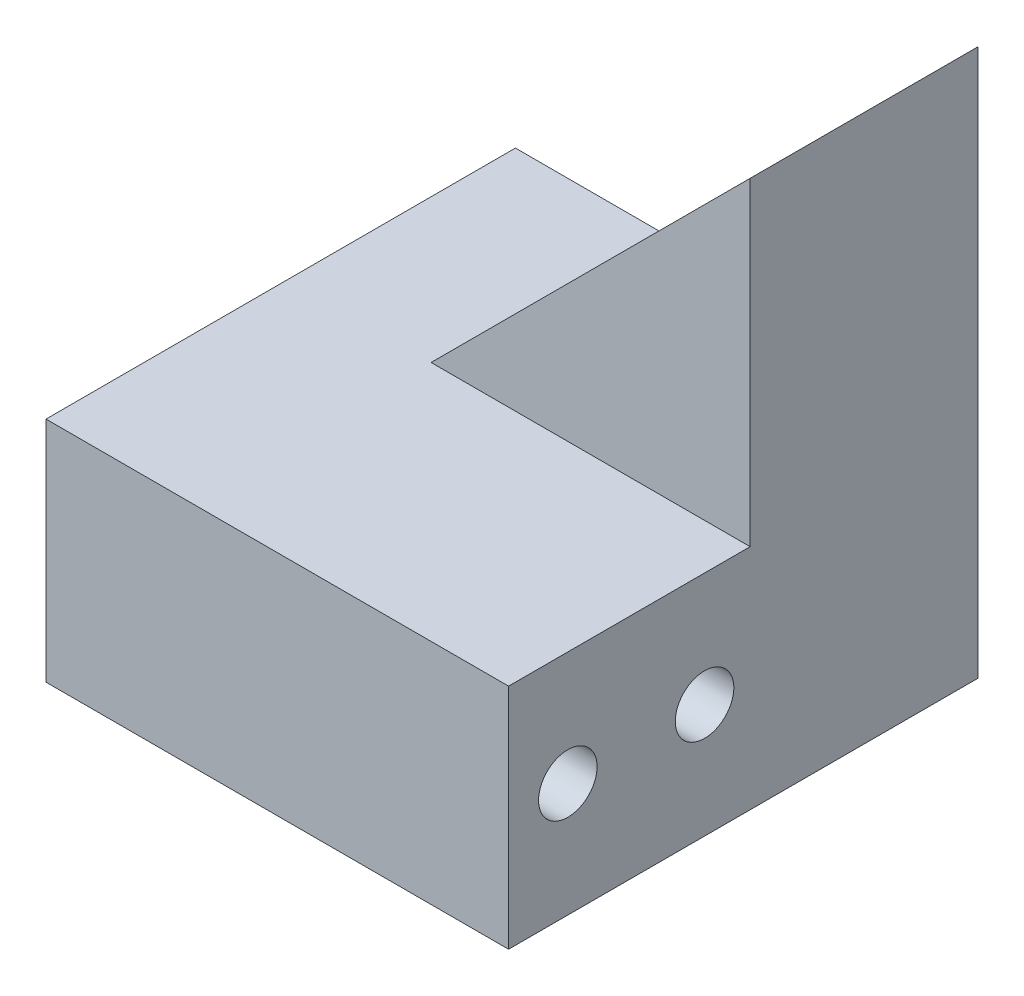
from build123d import *

# Parameters (mm, degrees)
SKETCH1_W                        = 17.78
SKETCH1_H                        = 28.702
BOSS_EXTRUDE1_DEPTH              = 30.48
SKETCH2_W                        = 16.002
SKETCH2_H                        = 17.78
CUT_EXTRUDE1_DEPTH               = 30.48
CUT_EXTRUDE2_DEPTH               = 30.48
SKETCH7_W                        = 2.54
SKETCH7_H                        = 12.7
CUT_EXTRUDE3_DEPTH               = 39.976766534
SKETCH8_W                        = 26.162
SKETCH8_H                        = 12.7
BOSS_EXTRUDE2_DEPTH              = 8
F_30_0_1285_DIAMETER_HOLE1_D     = 3.2639
F_30_0_1285_DIAMETER_HOLE1_DEPTH = 50.8
F_30_0_1285_DIAMETER_HOLE1_TIP   = 0.980574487


with BuildPart() as part:
    # Sketch1 → Boss-Extrude1 (new body)
    with BuildSketch(Plane(origin=(0, 0, 0), x_dir=(1, 0, 0), z_dir=(0, 1, 0))):
        with Locations((-21.564816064, 2.202837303)):
            Rectangle(SKETCH1_W, SKETCH1_H)
    extrude(amount=BOSS_EXTRUDE1_DEPTH)

    # Sketch2 → Cut-Extrude1 (cut)
    with BuildSketch(Plane.ZY.offset(30.454816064)):
        with Locations((4.147162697, 21.59)):
            Rectangle(SKETCH2_W, SKETCH2_H)
    extrude(amount=-CUT_EXTRUDE1_DEPTH, mode=Mode.SUBTRACT)

    # Sketch3 → Cut-Extrude2 (cut)
    with BuildSketch(Plane.XY.offset(-3.853837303)):
        Polygon((-30.454816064, 30.48), (-30.454816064, 12.7), (-12.674816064, 30.48), align=None)
    extrude(amount=-CUT_EXTRUDE2_DEPTH, mode=Mode.SUBTRACT)

    # Sketch7 → Cut-Extrude3 (cut, through all)
    with BuildSketch(Plane.ZY.offset(30.454816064)):
        with Locations((10.878162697, 6.35)):
            Rectangle(SKETCH7_W, SKETCH7_H)
    extrude(amount=-CUT_EXTRUDE3_DEPTH, mode=Mode.SUBTRACT)

    # Sketch8 → Boss-Extrude2 (add)
    with BuildSketch(Plane.ZY.offset(30.454816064)):
        with Locations((-3.472837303, 6.35)):
            Rectangle(SKETCH8_W, SKETCH8_H)
    extrude(amount=BOSS_EXTRUDE2_DEPTH)

    # 30 _0.1285_ Diameter Hole1
    with Locations(Plane.ZY.offset(38.454816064)):
        with Locations((-1.313837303, 6.35), (6.306162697, 6.35)):
            Hole(F_30_0_1285_DIAMETER_HOLE1_D / 2, depth=F_30_0_1285_DIAMETER_HOLE1_DEPTH)
            with Locations((0, 0, -(F_30_0_1285_DIAMETER_HOLE1_DEPTH + F_30_0_1285_DIAMETER_HOLE1_TIP / 2))):  # 118° drill point
                Cone(0, F_30_0_1285_DIAMETER_HOLE1_D / 2, F_30_0_1285_DIAMETER_HOLE1_TIP, mode=Mode.SUBTRACT)


solid = part.part
